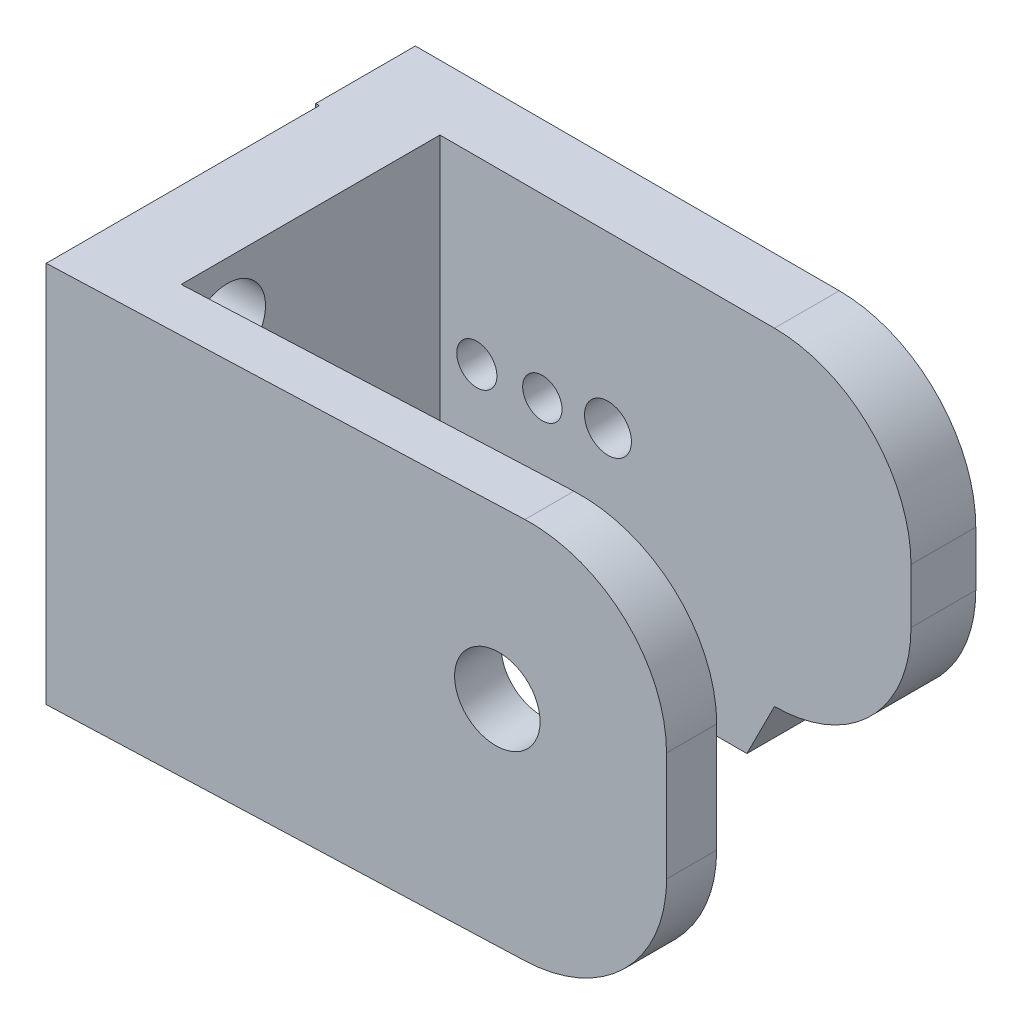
ISO-10303-21;
HEADER;
FILE_DESCRIPTION(('STEP AP214'),'2;1');
FILE_NAME('part.step','',(''),(''),'','','');
FILE_SCHEMA(('AUTOMOTIVE_DESIGN { 1 0 10303 214 1 1 1 1 }'));
ENDSEC;
DATA;
#1=APPLICATION_CONTEXT('core data for automotive mechanical design processes');
#2=APPLICATION_PROTOCOL_DEFINITION('international standard','automotive_design',2000,#1);
#3=PRODUCT_CONTEXT('',#1,'mechanical');
#4=PRODUCT('Part','Part','',(#3));
#5=PRODUCT_RELATED_PRODUCT_CATEGORY('part','',(#4));
#6=PRODUCT_DEFINITION_FORMATION('','',#4);
#7=PRODUCT_DEFINITION_CONTEXT('part definition',#1,'design');
#8=PRODUCT_DEFINITION('design','',#6,#7);
#9=PRODUCT_DEFINITION_SHAPE('','',#8);
#10=(LENGTH_UNIT() NAMED_UNIT(*) SI_UNIT(.MILLI.,.METRE.));
#11=(NAMED_UNIT(*) PLANE_ANGLE_UNIT() SI_UNIT($,.RADIAN.));
#12=(NAMED_UNIT(*) SI_UNIT($,.STERADIAN.) SOLID_ANGLE_UNIT());
#13=UNCERTAINTY_MEASURE_WITH_UNIT(LENGTH_MEASURE(1.E-05),#10,'distance_accuracy_value','');
#14=(GEOMETRIC_REPRESENTATION_CONTEXT(3) GLOBAL_UNCERTAINTY_ASSIGNED_CONTEXT((#13)) GLOBAL_UNIT_ASSIGNED_CONTEXT((#10,
#11,#12)) REPRESENTATION_CONTEXT('',''));
#15=CARTESIAN_POINT('',(0.,0.,0.));
#16=DIRECTION('',(0.,0.,1.));
#17=DIRECTION('',(1.,0.,0.));
#18=AXIS2_PLACEMENT_3D('',#15,#16,#17);
#19=CARTESIAN_POINT('',(0.,-2.,0.));
#20=DIRECTION('',(0.,1.,0.));
#21=DIRECTION('',(0.,0.,1.));
#22=AXIS2_PLACEMENT_3D('',#19,#20,#21);
#23=PLANE('',#22);
#24=DIRECTION('',(1.,0.,0.));
#25=VECTOR('',#24,1.);
#26=CARTESIAN_POINT('',(0.,-2.,-3.47523704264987));
#27=LINE('',#26,#25);
#28=CARTESIAN_POINT('',(-35.828035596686,-2.,-3.47523704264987));
#29=VERTEX_POINT('',#28);
#30=CARTESIAN_POINT('',(-20.4305070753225,-2.,-3.47523704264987));
#31=VERTEX_POINT('',#30);
#32=EDGE_CURVE('E205',#29,#31,#27,.T.);
#33=ORIENTED_EDGE('',*,*,#32,.F.);
#34=DIRECTION('',(0.,0.,1.));
#35=VECTOR('',#34,1.);
#36=CARTESIAN_POINT('',(-35.828035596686,-2.,0.));
#37=LINE('',#36,#35);
#38=CARTESIAN_POINT('',(-35.828035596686,-2.,0.));
#39=VERTEX_POINT('',#38);
#40=EDGE_CURVE('E60',#29,#39,#37,.T.);
#41=ORIENTED_EDGE('',*,*,#40,.T.);
#42=DIRECTION('',(1.,0.,0.));
#43=VECTOR('',#42,1.);
#44=CARTESIAN_POINT('',(-35.9592578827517,-2.,0.));
#45=LINE('',#44,#43);
#46=CARTESIAN_POINT('',(-35.9592578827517,-2.,0.));
#47=VERTEX_POINT('',#46);
#48=EDGE_CURVE('E341',#47,#39,#45,.T.);
#49=ORIENTED_EDGE('',*,*,#48,.F.);
#50=DIRECTION('',(0.,0.,1.));
#51=VECTOR('',#50,1.);
#52=CARTESIAN_POINT('',(-35.9592578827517,-2.,-3.6496923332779));
#53=LINE('',#52,#51);
#54=CARTESIAN_POINT('',(-35.9592578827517,-2.,-3.6496923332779));
#55=VERTEX_POINT('',#54);
#56=EDGE_CURVE('E338',#55,#47,#53,.T.);
#57=ORIENTED_EDGE('',*,*,#56,.F.);
#58=DIRECTION('',(-1.,0.,0.));
#59=VECTOR('',#58,1.);
#60=CARTESIAN_POINT('',(-35.9592578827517,-2.,-3.6496923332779));
#61=LINE('',#60,#59);
#62=CARTESIAN_POINT('',(-20.4305070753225,-2.,-3.6496923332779));
#63=VERTEX_POINT('',#62);
#64=EDGE_CURVE('E344',#63,#55,#61,.T.);
#65=ORIENTED_EDGE('',*,*,#64,.F.);
#66=DIRECTION('',(0.,0.,-1.));
#67=VECTOR('',#66,1.);
#68=CARTESIAN_POINT('',(-20.4305070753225,-2.,-1.27523704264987));
#69=LINE('',#68,#67);
#70=EDGE_CURVE('E398',#63,#31,#69,.F.);
#71=ORIENTED_EDGE('',*,*,#70,.T.);
#72=EDGE_LOOP('',(#33,#41,#49,#57,#65,#71));
#73=FACE_BOUND('',#72,.T.);
#74=ADVANCED_FACE('F45',(#73),#23,.F.);
#75=CARTESIAN_POINT('',(-35.9592578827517,-2.,0.));
#76=DIRECTION('',(0.,0.,1.));
#77=DIRECTION('',(1.,0.,0.));
#78=AXIS2_PLACEMENT_3D('',#75,#76,#77);
#79=PLANE('',#78);
#80=DIRECTION('',(1.,0.,0.));
#81=VECTOR('',#80,1.);
#82=CARTESIAN_POINT('',(-44.686094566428,-1.16426585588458,0.));
#83=LINE('',#82,#81);
#84=CARTESIAN_POINT('',(-35.9592578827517,-1.16426585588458,0.));
#85=VERTEX_POINT('',#84);
#86=CARTESIAN_POINT('',(-35.828035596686,-1.16426585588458,0.));
#87=VERTEX_POINT('',#86);
#88=EDGE_CURVE('E244',#85,#87,#83,.T.);
#89=ORIENTED_EDGE('',*,*,#88,.F.);
#90=DIRECTION('',(0.,1.,0.));
#91=VECTOR('',#90,1.);
#92=CARTESIAN_POINT('',(-35.9592578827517,-2.,0.));
#93=LINE('',#92,#91);
#94=EDGE_CURVE('E355',#47,#85,#93,.T.);
#95=ORIENTED_EDGE('',*,*,#94,.F.);
#96=ORIENTED_EDGE('',*,*,#48,.T.);
#97=DIRECTION('',(0.,-1.,0.));
#98=VECTOR('',#97,1.);
#99=CARTESIAN_POINT('',(-35.828035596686,-2.,0.));
#100=LINE('',#99,#98);
#101=EDGE_CURVE('E282',#87,#39,#100,.T.);
#102=ORIENTED_EDGE('',*,*,#101,.F.);
#103=EDGE_LOOP('',(#89,#95,#96,#102));
#104=FACE_BOUND('',#103,.T.);
#105=ADVANCED_FACE('F492',(#104),#79,.T.);
#106=CARTESIAN_POINT('',(-35.9592578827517,-2.,-3.6496923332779));
#107=DIRECTION('',(-1.,0.,0.));
#108=DIRECTION('',(0.,0.,1.));
#109=AXIS2_PLACEMENT_3D('',#106,#107,#108);
#110=PLANE('',#109);
#111=CARTESIAN_POINT('',(-35.9592578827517,0.138347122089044,0.513029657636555));
#112=DIRECTION('',(-1.,0.,0.));
#113=DIRECTION('',(0.,0.,1.));
#114=AXIS2_PLACEMENT_3D('',#111,#112,#113);
#115=CIRCLE('',#114,1.4);
#116=CARTESIAN_POINT('',(-35.9592578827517,1.44096010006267,0.));
#117=VERTEX_POINT('',#116);
#118=EDGE_CURVE('E246',#117,#85,#115,.T.);
#119=ORIENTED_EDGE('',*,*,#118,.F.);
#120=CARTESIAN_POINT('',(-35.9592578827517,10.,0.));
#121=VERTEX_POINT('',#120);
#122=EDGE_CURVE('E346',#117,#121,#93,.T.);
#123=ORIENTED_EDGE('',*,*,#122,.T.);
#124=DIRECTION('',(0.,0.,1.));
#125=VECTOR('',#124,1.);
#126=CARTESIAN_POINT('',(-35.9592578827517,10.,-3.6496923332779));
#127=LINE('',#126,#125);
#128=CARTESIAN_POINT('',(-35.9592578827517,10.,-3.6496923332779));
#129=VERTEX_POINT('',#128);
#130=EDGE_CURVE('E330',#129,#121,#127,.T.);
#131=ORIENTED_EDGE('',*,*,#130,.F.);
#132=DIRECTION('',(0.,1.,0.));
#133=VECTOR('',#132,1.);
#134=CARTESIAN_POINT('',(-35.9592578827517,-2.,-3.6496923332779));
#135=LINE('',#134,#133);
#136=CARTESIAN_POINT('',(-35.9592578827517,6.06263160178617,-3.6496923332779));
#137=VERTEX_POINT('',#136);
#138=EDGE_CURVE('E351',#137,#129,#135,.T.);
#139=ORIENTED_EDGE('',*,*,#138,.F.);
#140=DIRECTION('',(0.,0.,-1.));
#141=VECTOR('',#140,1.);
#142=CARTESIAN_POINT('',(-35.9592578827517,6.06263160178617,-3.6496923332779));
#143=LINE('',#142,#141);
#144=CARTESIAN_POINT('',(-35.9592578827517,6.06263160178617,-2.6496923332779));
#145=VERTEX_POINT('',#144);
#146=EDGE_CURVE('E324',#145,#137,#143,.T.);
#147=ORIENTED_EDGE('',*,*,#146,.F.);
#148=DIRECTION('',(0.,-1.,0.));
#149=VECTOR('',#148,1.);
#150=CARTESIAN_POINT('',(-35.9592578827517,-2.,-2.6496923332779));
#151=LINE('',#150,#149);
#152=CARTESIAN_POINT('',(-35.9592578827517,0.589269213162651,-2.6496923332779));
#153=VERTEX_POINT('',#152);
#154=EDGE_CURVE('E359',#145,#153,#151,.T.);
#155=ORIENTED_EDGE('',*,*,#154,.T.);
#156=DIRECTION('',(0.,0.,1.));
#157=VECTOR('',#156,1.);
#158=CARTESIAN_POINT('',(-35.9592578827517,0.589269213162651,-3.6496923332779));
#159=LINE('',#158,#157);
#160=CARTESIAN_POINT('',(-35.9592578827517,0.589269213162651,-3.6496923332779));
#161=VERTEX_POINT('',#160);
#162=EDGE_CURVE('E328',#161,#153,#159,.T.);
#163=ORIENTED_EDGE('',*,*,#162,.F.);
#164=EDGE_CURVE('E347',#55,#161,#135,.T.);
#165=ORIENTED_EDGE('',*,*,#164,.F.);
#166=ORIENTED_EDGE('',*,*,#56,.T.);
#167=ORIENTED_EDGE('',*,*,#94,.T.);
#168=EDGE_LOOP('',(#119,#123,#131,#139,#147,#155,#163,#165,#166,#167));
#169=FACE_BOUND('',#168,.T.);
#170=ADVANCED_FACE('F428',(#169),#110,.T.);
#171=CARTESIAN_POINT('',(-35.9592578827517,-2.,-3.6496923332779));
#172=DIRECTION('',(0.,0.,-1.));
#173=DIRECTION('',(-1.,0.,0.));
#174=AXIS2_PLACEMENT_3D('',#171,#172,#173);
#175=PLANE('',#174);
#176=DIRECTION('',(0.,1.,0.));
#177=VECTOR('',#176,1.);
#178=CARTESIAN_POINT('',(-15.4305070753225,-2.,-3.6496923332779));
#179=LINE('',#178,#177);
#180=CARTESIAN_POINT('',(-15.4305070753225,3.,-3.6496923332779));
#181=VERTEX_POINT('',#180);
#182=CARTESIAN_POINT('',(-15.4305070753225,5.,-3.6496923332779));
#183=VERTEX_POINT('',#182);
#184=EDGE_CURVE('E352',#181,#183,#179,.T.);
#185=ORIENTED_EDGE('',*,*,#184,.F.);
#186=CARTESIAN_POINT('',(-20.4305070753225,3.,-3.6496923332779));
#187=DIRECTION('',(0.,0.,-1.));
#188=DIRECTION('',(-1.,0.,0.));
#189=AXIS2_PLACEMENT_3D('',#186,#187,#188);
#190=CIRCLE('',#189,5.);
#191=EDGE_CURVE('E396',#181,#63,#190,.T.);
#192=ORIENTED_EDGE('',*,*,#191,.T.);
#193=ORIENTED_EDGE('',*,*,#64,.T.);
#194=ORIENTED_EDGE('',*,*,#164,.T.);
#195=DIRECTION('',(-0.999906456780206,0.013677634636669,0.));
#196=VECTOR('',#195,1.);
#197=CARTESIAN_POINT('',(-37.7283054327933,0.613467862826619,-3.6496923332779));
#198=LINE('',#197,#196);
#199=CARTESIAN_POINT('',(-20.6880227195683,0.380375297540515,-3.6496923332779));
#200=VERTEX_POINT('',#199);
#201=EDGE_CURVE('E303',#200,#161,#198,.T.);
#202=ORIENTED_EDGE('',*,*,#201,.F.);
#203=CARTESIAN_POINT('',(-20.6880227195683,4.29733611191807,-3.6496923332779));
#204=DIRECTION('',(0.,0.,-1.));
#205=DIRECTION('',(-1.,0.,0.));
#206=AXIS2_PLACEMENT_3D('',#203,#204,#205);
#207=CIRCLE('',#206,3.91696081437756);
#208=CARTESIAN_POINT('',(-21.2445019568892,8.17456616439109,-3.6496923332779));
#209=VERTEX_POINT('',#208);
#210=EDGE_CURVE('E313',#209,#200,#207,.T.);
#211=ORIENTED_EDGE('',*,*,#210,.F.);
#212=DIRECTION('',(0.989856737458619,0.142069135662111,0.));
#213=VECTOR('',#212,1.);
#214=CARTESIAN_POINT('',(-37.0930903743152,5.89989835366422,-3.6496923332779));
#215=LINE('',#214,#213);
#216=EDGE_CURVE('E350',#137,#209,#215,.T.);
#217=ORIENTED_EDGE('',*,*,#216,.F.);
#218=ORIENTED_EDGE('',*,*,#138,.T.);
#219=DIRECTION('',(-1.,0.,0.));
#220=VECTOR('',#219,1.);
#221=CARTESIAN_POINT('',(-35.9592578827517,10.,-3.6496923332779));
#222=LINE('',#221,#220);
#223=CARTESIAN_POINT('',(-20.4305070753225,10.,-3.6496923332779));
#224=VERTEX_POINT('',#223);
#225=EDGE_CURVE('E336',#224,#129,#222,.T.);
#226=ORIENTED_EDGE('',*,*,#225,.F.);
#227=CARTESIAN_POINT('',(-20.4305070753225,5.,-3.6496923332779));
#228=DIRECTION('',(0.,0.,-1.));
#229=DIRECTION('',(-1.,0.,0.));
#230=AXIS2_PLACEMENT_3D('',#227,#228,#229);
#231=CIRCLE('',#230,5.);
#232=EDGE_CURVE('E394',#224,#183,#231,.T.);
#233=ORIENTED_EDGE('',*,*,#232,.T.);
#234=EDGE_LOOP('',(#185,#192,#193,#194,#202,#211,#217,#218,#226,#233));
#235=FACE_BOUND('',#234,.T.);
#236=ADVANCED_FACE('F415',(#235),#175,.T.);
#237=CARTESIAN_POINT('',(-15.4305070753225,-2.,-3.6496923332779));
#238=DIRECTION('',(1.,0.,0.));
#239=DIRECTION('',(0.,0.,-1.));
#240=AXIS2_PLACEMENT_3D('',#237,#238,#239);
#241=PLANE('',#240);
#242=DIRECTION('',(0.,1.,0.));
#243=VECTOR('',#242,1.);
#244=CARTESIAN_POINT('',(-15.4305070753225,-2.,-1.27523704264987));
#245=LINE('',#244,#243);
#246=CARTESIAN_POINT('',(-15.4305070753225,3.,-1.27523704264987));
#247=VERTEX_POINT('',#246);
#248=CARTESIAN_POINT('',(-15.4305070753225,5.,-1.27523704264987));
#249=VERTEX_POINT('',#248);
#250=EDGE_CURVE('E296',#247,#249,#245,.T.);
#251=ORIENTED_EDGE('',*,*,#250,.F.);
#252=DIRECTION('',(0.,0.,-1.));
#253=VECTOR('',#252,1.);
#254=CARTESIAN_POINT('',(-15.4305070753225,3.,-3.6496923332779));
#255=LINE('',#254,#253);
#256=EDGE_CURVE('E391',#247,#181,#255,.T.);
#257=ORIENTED_EDGE('',*,*,#256,.T.);
#258=ORIENTED_EDGE('',*,*,#184,.T.);
#259=DIRECTION('',(0.,0.,-1.));
#260=VECTOR('',#259,1.);
#261=CARTESIAN_POINT('',(-15.4305070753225,5.,-3.6496923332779));
#262=LINE('',#261,#260);
#263=EDGE_CURVE('E389',#183,#249,#262,.F.);
#264=ORIENTED_EDGE('',*,*,#263,.T.);
#265=EDGE_LOOP('',(#251,#257,#258,#264));
#266=FACE_BOUND('',#265,.T.);
#267=ADVANCED_FACE('F418',(#266),#241,.T.);
#268=DIRECTION('',(1.,0.,0.));
#269=VECTOR('',#268,1.);
#270=CARTESIAN_POINT('',(-44.686094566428,1.44096010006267,0.));
#271=LINE('',#270,#269);
#272=CARTESIAN_POINT('',(-35.828035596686,1.44096010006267,0.));
#273=VERTEX_POINT('',#272);
#274=EDGE_CURVE('E240',#273,#117,#271,.F.);
#275=ORIENTED_EDGE('',*,*,#274,.F.);
#276=CARTESIAN_POINT('',(-35.828035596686,10.,0.));
#277=VERTEX_POINT('',#276);
#278=EDGE_CURVE('E283',#277,#273,#100,.T.);
#279=ORIENTED_EDGE('',*,*,#278,.F.);
#280=DIRECTION('',(1.,0.,0.));
#281=VECTOR('',#280,1.);
#282=CARTESIAN_POINT('',(-35.9592578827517,10.,0.));
#283=LINE('',#282,#281);
#284=EDGE_CURVE('E333',#121,#277,#283,.T.);
#285=ORIENTED_EDGE('',*,*,#284,.F.);
#286=ORIENTED_EDGE('',*,*,#122,.F.);
#287=EDGE_LOOP('',(#275,#279,#285,#286));
#288=FACE_BOUND('',#287,.T.);
#289=ADVANCED_FACE('F499',(#288),#79,.T.);
#290=CARTESIAN_POINT('',(0.,10.,0.));
#291=DIRECTION('',(0.,1.,0.));
#292=DIRECTION('',(0.,0.,1.));
#293=AXIS2_PLACEMENT_3D('',#290,#291,#292);
#294=PLANE('',#293);
#295=DIRECTION('',(0.999288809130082,0.,-0.0377077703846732));
#296=VECTOR('',#295,1.);
#297=CARTESIAN_POINT('',(-13.9315382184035,10.,9.17798467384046));
#298=LINE('',#297,#296);
#299=CARTESIAN_POINT('',(-35.828035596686,10.,10.0042403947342));
#300=VERTEX_POINT('',#299);
#301=CARTESIAN_POINT('',(-18.9315382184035,10.,9.36665770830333));
#302=VERTEX_POINT('',#301);
#303=EDGE_CURVE('E261',#300,#302,#298,.T.);
#304=ORIENTED_EDGE('',*,*,#303,.T.);
#305=DIRECTION('',(0.,0.,-1.));
#306=VECTOR('',#305,1.);
#307=CARTESIAN_POINT('',(-18.9315382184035,10.,0.));
#308=LINE('',#307,#306);
#309=CARTESIAN_POINT('',(-18.9315382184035,10.,7.57083289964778));
#310=VERTEX_POINT('',#309);
#311=EDGE_CURVE('E386',#302,#310,#308,.T.);
#312=ORIENTED_EDGE('',*,*,#311,.T.);
#313=DIRECTION('',(-0.998946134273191,0.,0.0458979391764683));
#314=VECTOR('',#313,1.);
#315=CARTESIAN_POINT('',(-32.686094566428,10.,8.20280470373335));
#316=LINE('',#315,#314);
#317=CARTESIAN_POINT('',(-32.686094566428,10.,8.20280470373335));
#318=VERTEX_POINT('',#317);
#319=EDGE_CURVE('E264',#310,#318,#316,.T.);
#320=ORIENTED_EDGE('',*,*,#319,.T.);
#321=DIRECTION('',(0.,0.,-1.));
#322=VECTOR('',#321,1.);
#323=CARTESIAN_POINT('',(-32.686094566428,10.,-1.27523704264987));
#324=LINE('',#323,#322);
#325=CARTESIAN_POINT('',(-32.686094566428,10.,-1.27523704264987));
#326=VERTEX_POINT('',#325);
#327=EDGE_CURVE('E251',#318,#326,#324,.T.);
#328=ORIENTED_EDGE('',*,*,#327,.T.);
#329=DIRECTION('',(-1.,0.,0.));
#330=VECTOR('',#329,1.);
#331=CARTESIAN_POINT('',(-14.9799626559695,10.,-1.27523704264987));
#332=LINE('',#331,#330);
#333=CARTESIAN_POINT('',(-20.4305070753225,10.,-1.27523704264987));
#334=VERTEX_POINT('',#333);
#335=EDGE_CURVE('E286',#334,#326,#332,.T.);
#336=ORIENTED_EDGE('',*,*,#335,.F.);
#337=DIRECTION('',(0.,0.,-1.));
#338=VECTOR('',#337,1.);
#339=CARTESIAN_POINT('',(-20.4305070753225,10.,0.));
#340=LINE('',#339,#338);
#341=EDGE_CURVE('E383',#334,#224,#340,.T.);
#342=ORIENTED_EDGE('',*,*,#341,.T.);
#343=ORIENTED_EDGE('',*,*,#225,.T.);
#344=ORIENTED_EDGE('',*,*,#130,.T.);
#345=ORIENTED_EDGE('',*,*,#284,.T.);
#346=DIRECTION('',(0.,0.,1.));
#347=VECTOR('',#346,1.);
#348=CARTESIAN_POINT('',(-35.828035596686,10.,10.0042403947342));
#349=LINE('',#348,#347);
#350=EDGE_CURVE('E259',#277,#300,#349,.T.);
#351=ORIENTED_EDGE('',*,*,#350,.T.);
#352=EDGE_LOOP('',(#304,#312,#320,#328,#336,#342,#343,#344,#345,#351));
#353=FACE_BOUND('',#352,.T.);
#354=ADVANCED_FACE('F410',(#353),#294,.T.);
#355=CARTESIAN_POINT('',(-37.7283054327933,0.613467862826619,-2.6496923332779));
#356=DIRECTION('',(-0.013677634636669,-0.999906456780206,0.));
#357=DIRECTION('',(0.999906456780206,-0.013677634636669,0.));
#358=AXIS2_PLACEMENT_3D('',#355,#356,#357);
#359=PLANE('',#358);
#360=ORIENTED_EDGE('',*,*,#162,.T.);
#361=DIRECTION('',(-0.999906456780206,0.013677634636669,0.));
#362=VECTOR('',#361,1.);
#363=CARTESIAN_POINT('',(-37.7283054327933,0.613467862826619,-2.6496923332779));
#364=LINE('',#363,#362);
#365=CARTESIAN_POINT('',(-20.6880227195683,0.380375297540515,-2.6496923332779));
#366=VERTEX_POINT('',#365);
#367=EDGE_CURVE('E309',#366,#153,#364,.T.);
#368=ORIENTED_EDGE('',*,*,#367,.F.);
#369=DIRECTION('',(0.,0.,-1.));
#370=VECTOR('',#369,1.);
#371=CARTESIAN_POINT('',(-20.6880227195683,0.380375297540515,-2.6496923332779));
#372=LINE('',#371,#370);
#373=EDGE_CURVE('E322',#366,#200,#372,.T.);
#374=ORIENTED_EDGE('',*,*,#373,.T.);
#375=ORIENTED_EDGE('',*,*,#201,.T.);
#376=EDGE_LOOP('',(#360,#368,#374,#375));
#377=FACE_BOUND('',#376,.T.);
#378=ADVANCED_FACE('F434',(#377),#359,.F.);
#379=CARTESIAN_POINT('',(-20.6880227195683,4.29733611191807,-2.6496923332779));
#380=DIRECTION('',(0.,0.,-1.));
#381=DIRECTION('',(-1.,0.,0.));
#382=AXIS2_PLACEMENT_3D('',#379,#380,#381);
#383=CYLINDRICAL_SURFACE('',#382,3.91696081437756);
#384=ORIENTED_EDGE('',*,*,#210,.T.);
#385=ORIENTED_EDGE('',*,*,#373,.F.);
#386=CARTESIAN_POINT('',(-20.6880227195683,4.29733611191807,-2.6496923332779));
#387=DIRECTION('',(0.,0.,-1.));
#388=DIRECTION('',(-1.,0.,0.));
#389=AXIS2_PLACEMENT_3D('',#386,#387,#388);
#390=CIRCLE('',#389,3.91696081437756);
#391=CARTESIAN_POINT('',(-21.2445019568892,8.17456616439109,-2.6496923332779));
#392=VERTEX_POINT('',#391);
#393=EDGE_CURVE('E315',#392,#366,#390,.T.);
#394=ORIENTED_EDGE('',*,*,#393,.F.);
#395=DIRECTION('',(0.,0.,-1.));
#396=VECTOR('',#395,1.);
#397=CARTESIAN_POINT('',(-21.2445019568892,8.17456616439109,-2.6496923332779));
#398=LINE('',#397,#396);
#399=EDGE_CURVE('E318',#392,#209,#398,.T.);
#400=ORIENTED_EDGE('',*,*,#399,.T.);
#401=EDGE_LOOP('',(#384,#385,#394,#400));
#402=FACE_BOUND('',#401,.T.);
#403=ADVANCED_FACE('F438',(#402),#383,.F.);
#404=CARTESIAN_POINT('',(-21.2445019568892,8.17456616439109,-2.6496923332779));
#405=DIRECTION('',(-0.142069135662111,0.989856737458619,0.));
#406=DIRECTION('',(-0.989856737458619,-0.142069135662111,0.));
#407=AXIS2_PLACEMENT_3D('',#404,#405,#406);
#408=PLANE('',#407);
#409=ORIENTED_EDGE('',*,*,#146,.T.);
#410=ORIENTED_EDGE('',*,*,#216,.T.);
#411=ORIENTED_EDGE('',*,*,#399,.F.);
#412=DIRECTION('',(0.989856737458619,0.142069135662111,0.));
#413=VECTOR('',#412,1.);
#414=CARTESIAN_POINT('',(-21.2445019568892,8.17456616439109,-2.6496923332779));
#415=LINE('',#414,#413);
#416=EDGE_CURVE('E312',#145,#392,#415,.T.);
#417=ORIENTED_EDGE('',*,*,#416,.F.);
#418=EDGE_LOOP('',(#409,#410,#411,#417));
#419=FACE_BOUND('',#418,.T.);
#420=ADVANCED_FACE('F442',(#419),#408,.F.);
#421=CARTESIAN_POINT('',(-20.6880227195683,4.29733611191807,-2.6496923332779));
#422=DIRECTION('',(0.,0.,-1.));
#423=DIRECTION('',(-1.,0.,0.));
#424=AXIS2_PLACEMENT_3D('',#421,#422,#423);
#425=PLANE('',#424);
#426=CARTESIAN_POINT('',(-31.3337235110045,3.39696779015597,-2.6496923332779));
#427=DIRECTION('',(0.,0.,-1.));
#428=DIRECTION('',(-1.,0.,0.));
#429=AXIS2_PLACEMENT_3D('',#426,#427,#428);
#430=CIRCLE('',#429,0.73588943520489);
#431=CARTESIAN_POINT('',(-32.0696129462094,3.39696779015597,-2.6496923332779));
#432=VERTEX_POINT('',#431);
#433=EDGE_CURVE('E300',#432,#432,#430,.T.);
#434=ORIENTED_EDGE('',*,*,#433,.F.);
#435=EDGE_LOOP('',(#434));
#436=FACE_BOUND('',#435,.T.);
#437=CARTESIAN_POINT('',(-28.9339325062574,3.53139617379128,-2.6496923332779));
#438=DIRECTION('',(0.,0.,-1.));
#439=DIRECTION('',(-1.,0.,0.));
#440=AXIS2_PLACEMENT_3D('',#437,#438,#439);
#441=CIRCLE('',#440,0.720970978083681);
#442=CARTESIAN_POINT('',(-29.6549034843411,3.53139617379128,-2.6496923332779));
#443=VERTEX_POINT('',#442);
#444=EDGE_CURVE('E304',#443,#443,#441,.T.);
#445=ORIENTED_EDGE('',*,*,#444,.F.);
#446=EDGE_LOOP('',(#445));
#447=FACE_BOUND('',#446,.T.);
#448=CARTESIAN_POINT('',(-26.5287876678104,3.77558013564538,-2.6496923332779));
#449=DIRECTION('',(0.,0.,-1.));
#450=DIRECTION('',(-1.,0.,0.));
#451=AXIS2_PLACEMENT_3D('',#448,#449,#450);
#452=CIRCLE('',#451,0.858730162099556);
#453=CARTESIAN_POINT('',(-27.38751782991,3.77558013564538,-2.6496923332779));
#454=VERTEX_POINT('',#453);
#455=EDGE_CURVE('E299',#454,#454,#452,.T.);
#456=ORIENTED_EDGE('',*,*,#455,.F.);
#457=EDGE_LOOP('',(#456));
#458=FACE_BOUND('',#457,.T.);
#459=ORIENTED_EDGE('',*,*,#416,.T.);
#460=ORIENTED_EDGE('',*,*,#393,.T.);
#461=ORIENTED_EDGE('',*,*,#367,.T.);
#462=ORIENTED_EDGE('',*,*,#154,.F.);
#463=EDGE_LOOP('',(#459,#460,#461,#462));
#464=FACE_BOUND('',#463,.T.);
#465=ADVANCED_FACE('F561',(#436,#447,#458,#464),#425,.T.);
#466=CARTESIAN_POINT('',(-26.5287876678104,3.77558013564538,3.3503076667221));
#467=DIRECTION('',(0.,0.,-1.));
#468=DIRECTION('',(-1.,0.,0.));
#469=AXIS2_PLACEMENT_3D('',#466,#467,#468);
#470=CYLINDRICAL_SURFACE('',#469,0.858730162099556);
#471=CARTESIAN_POINT('',(-26.5287876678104,3.77558013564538,-1.27523704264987));
#472=DIRECTION('',(0.,0.,-1.));
#473=DIRECTION('',(-1.,0.,0.));
#474=AXIS2_PLACEMENT_3D('',#471,#472,#473);
#475=CIRCLE('',#474,0.858730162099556);
#476=CARTESIAN_POINT('',(-27.38751782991,3.77558013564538,-1.27523704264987));
#477=VERTEX_POINT('',#476);
#478=EDGE_CURVE('E293',#477,#477,#475,.F.);
#479=ORIENTED_EDGE('',*,*,#478,.T.);
#480=EDGE_LOOP('',(#479));
#481=FACE_BOUND('',#480,.T.);
#482=ORIENTED_EDGE('',*,*,#455,.T.);
#483=EDGE_LOOP('',(#482));
#484=FACE_BOUND('',#483,.T.);
#485=ADVANCED_FACE('F557',(#481,#484),#470,.F.);
#486=CARTESIAN_POINT('',(-28.9339325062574,3.53139617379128,3.3503076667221));
#487=DIRECTION('',(0.,0.,-1.));
#488=DIRECTION('',(-1.,0.,0.));
#489=AXIS2_PLACEMENT_3D('',#486,#487,#488);
#490=CYLINDRICAL_SURFACE('',#489,0.720970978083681);
#491=CARTESIAN_POINT('',(-28.9339325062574,3.53139617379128,-1.27523704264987));
#492=DIRECTION('',(0.,0.,-1.));
#493=DIRECTION('',(-1.,0.,0.));
#494=AXIS2_PLACEMENT_3D('',#491,#492,#493);
#495=CIRCLE('',#494,0.720970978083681);
#496=CARTESIAN_POINT('',(-29.6549034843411,3.53139617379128,-1.27523704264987));
#497=VERTEX_POINT('',#496);
#498=EDGE_CURVE('E290',#497,#497,#495,.F.);
#499=ORIENTED_EDGE('',*,*,#498,.T.);
#500=EDGE_LOOP('',(#499));
#501=FACE_BOUND('',#500,.T.);
#502=ORIENTED_EDGE('',*,*,#444,.T.);
#503=EDGE_LOOP('',(#502));
#504=FACE_BOUND('',#503,.T.);
#505=ADVANCED_FACE('F553',(#501,#504),#490,.F.);
#506=CARTESIAN_POINT('',(-31.3337235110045,3.39696779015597,3.3503076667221));
#507=DIRECTION('',(0.,0.,-1.));
#508=DIRECTION('',(-1.,0.,0.));
#509=AXIS2_PLACEMENT_3D('',#506,#507,#508);
#510=CYLINDRICAL_SURFACE('',#509,0.73588943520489);
#511=CARTESIAN_POINT('',(-31.3337235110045,3.39696779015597,-1.27523704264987));
#512=DIRECTION('',(0.,0.,-1.));
#513=DIRECTION('',(-1.,0.,0.));
#514=AXIS2_PLACEMENT_3D('',#511,#512,#513);
#515=CIRCLE('',#514,0.73588943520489);
#516=CARTESIAN_POINT('',(-32.0696129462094,3.39696779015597,-1.27523704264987));
#517=VERTEX_POINT('',#516);
#518=EDGE_CURVE('E289',#517,#517,#515,.F.);
#519=ORIENTED_EDGE('',*,*,#518,.T.);
#520=EDGE_LOOP('',(#519));
#521=FACE_BOUND('',#520,.T.);
#522=ORIENTED_EDGE('',*,*,#433,.T.);
#523=EDGE_LOOP('',(#522));
#524=FACE_BOUND('',#523,.T.);
#525=ADVANCED_FACE('F486',(#521,#524),#510,.F.);
#526=CARTESIAN_POINT('',(-14.9799626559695,-8.00000000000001,-1.27523704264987));
#527=DIRECTION('',(0.,0.,-1.));
#528=DIRECTION('',(-1.,0.,0.));
#529=AXIS2_PLACEMENT_3D('',#526,#527,#528);
#530=PLANE('',#529);
#531=ORIENTED_EDGE('',*,*,#335,.T.);
#532=DIRECTION('',(0.,1.,0.));
#533=VECTOR('',#532,1.);
#534=CARTESIAN_POINT('',(-32.686094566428,-4.00000000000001,-1.27523704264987));
#535=LINE('',#534,#533);
#536=CARTESIAN_POINT('',(-32.686094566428,-4.00000000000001,-1.27523704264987));
#537=VERTEX_POINT('',#536);
#538=EDGE_CURVE('E268',#537,#326,#535,.T.);
#539=ORIENTED_EDGE('',*,*,#538,.F.);
#540=DIRECTION('',(-1.,0.,0.));
#541=VECTOR('',#540,1.);
#542=CARTESIAN_POINT('',(-35.828035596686,-4.00000000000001,-1.27523704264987));
#543=LINE('',#542,#541);
#544=CARTESIAN_POINT('',(-21.4404238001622,-4.00000000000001,-1.27523704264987));
#545=VERTEX_POINT('',#544);
#546=EDGE_CURVE('E226',#545,#537,#543,.T.);
#547=ORIENTED_EDGE('',*,*,#546,.F.);
#548=DIRECTION('',(-0.450750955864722,-0.892649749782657,0.));
#549=VECTOR('',#548,1.);
#550=CARTESIAN_POINT('',(-21.4404238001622,-4.00000000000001,-1.27523704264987));
#551=LINE('',#550,#549);
#552=CARTESIAN_POINT('',(-20.4305070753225,-2.,-1.27523704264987));
#553=VERTEX_POINT('',#552);
#554=EDGE_CURVE('E213',#553,#545,#551,.T.);
#555=ORIENTED_EDGE('',*,*,#554,.F.);
#556=CARTESIAN_POINT('',(-20.4305070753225,3.,-1.27523704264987));
#557=DIRECTION('',(0.,0.,-1.));
#558=DIRECTION('',(-1.,0.,0.));
#559=AXIS2_PLACEMENT_3D('',#556,#557,#558);
#560=CIRCLE('',#559,5.);
#561=EDGE_CURVE('E13',#553,#247,#560,.F.);
#562=ORIENTED_EDGE('',*,*,#561,.T.);
#563=ORIENTED_EDGE('',*,*,#250,.T.);
#564=CARTESIAN_POINT('',(-20.4305070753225,5.,-1.27523704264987));
#565=DIRECTION('',(0.,0.,-1.));
#566=DIRECTION('',(-1.,0.,0.));
#567=AXIS2_PLACEMENT_3D('',#564,#565,#566);
#568=CIRCLE('',#567,5.);
#569=EDGE_CURVE('E53',#249,#334,#568,.F.);
#570=ORIENTED_EDGE('',*,*,#569,.T.);
#571=EDGE_LOOP('',(#531,#539,#547,#555,#562,#563,#570));
#572=FACE_BOUND('',#571,.T.);
#573=ORIENTED_EDGE('',*,*,#478,.F.);
#574=EDGE_LOOP('',(#573));
#575=FACE_BOUND('',#574,.T.);
#576=ORIENTED_EDGE('',*,*,#518,.F.);
#577=EDGE_LOOP('',(#576));
#578=FACE_BOUND('',#577,.T.);
#579=ORIENTED_EDGE('',*,*,#498,.F.);
#580=EDGE_LOOP('',(#579));
#581=FACE_BOUND('',#580,.T.);
#582=ADVANCED_FACE('F402',(#572,#575,#578,#581),#530,.F.);
#583=CARTESIAN_POINT('',(-32.686094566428,-4.00000000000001,-1.27523704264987));
#584=DIRECTION('',(1.,0.,0.));
#585=DIRECTION('',(0.,0.,-1.));
#586=AXIS2_PLACEMENT_3D('',#583,#584,#585);
#587=PLANE('',#586);
#588=CARTESIAN_POINT('',(-32.686094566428,7.78352574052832,6.51309421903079));
#589=DIRECTION('',(1.,0.,0.));
#590=DIRECTION('',(0.,0.,-1.));
#591=AXIS2_PLACEMENT_3D('',#588,#589,#590);
#592=CIRCLE('',#591,1.4);
#593=CARTESIAN_POINT('',(-32.686094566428,7.78352574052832,5.11309421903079));
#594=VERTEX_POINT('',#593);
#595=EDGE_CURVE('E237',#594,#594,#592,.T.);
#596=ORIENTED_EDGE('',*,*,#595,.F.);
#597=EDGE_LOOP('',(#596));
#598=FACE_BOUND('',#597,.T.);
#599=CARTESIAN_POINT('',(-32.686094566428,0.138347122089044,0.513029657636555));
#600=DIRECTION('',(1.,0.,0.));
#601=DIRECTION('',(0.,0.,-1.));
#602=AXIS2_PLACEMENT_3D('',#599,#600,#601);
#603=CIRCLE('',#602,1.4);
#604=CARTESIAN_POINT('',(-32.686094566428,0.138347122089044,-0.886970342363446));
#605=VERTEX_POINT('',#604);
#606=EDGE_CURVE('E236',#605,#605,#603,.T.);
#607=ORIENTED_EDGE('',*,*,#606,.F.);
#608=EDGE_LOOP('',(#607));
#609=FACE_BOUND('',#608,.T.);
#610=ORIENTED_EDGE('',*,*,#327,.F.);
#611=DIRECTION('',(0.,1.,0.));
#612=VECTOR('',#611,1.);
#613=CARTESIAN_POINT('',(-32.686094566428,-4.00000000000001,8.20280470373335));
#614=LINE('',#613,#612);
#615=CARTESIAN_POINT('',(-32.686094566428,-4.00000000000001,8.20280470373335));
#616=VERTEX_POINT('',#615);
#617=EDGE_CURVE('E270',#616,#318,#614,.T.);
#618=ORIENTED_EDGE('',*,*,#617,.F.);
#619=DIRECTION('',(0.,0.,-1.));
#620=VECTOR('',#619,1.);
#621=CARTESIAN_POINT('',(-32.686094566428,-4.00000000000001,3.6799703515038));
#622=LINE('',#621,#620);
#623=EDGE_CURVE('E256',#616,#537,#622,.T.);
#624=ORIENTED_EDGE('',*,*,#623,.T.);
#625=ORIENTED_EDGE('',*,*,#538,.T.);
#626=EDGE_LOOP('',(#610,#618,#624,#625));
#627=FACE_BOUND('',#626,.T.);
#628=ADVANCED_FACE('F476',(#598,#609,#627),#587,.T.);
#629=CARTESIAN_POINT('',(-32.686094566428,-4.00000000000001,8.20280470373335));
#630=DIRECTION('',(-0.0458979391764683,0.,-0.998946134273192));
#631=DIRECTION('',(-0.998946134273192,0.,0.0458979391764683));
#632=AXIS2_PLACEMENT_3D('',#629,#630,#631);
#633=PLANE('',#632);
#634=CARTESIAN_POINT('',(-19.9711829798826,3.84055055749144,7.61860079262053));
#635=DIRECTION('',(-0.0458979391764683,0.,-0.998946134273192));
#636=DIRECTION('',(-0.998946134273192,0.,0.0458979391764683));
#637=AXIS2_PLACEMENT_3D('',#634,#635,#636);
#638=ELLIPSE('',#637,1.5095305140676,1.50947979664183);
#639=CARTESIAN_POINT('',(-21.4791226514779,3.84055055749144,7.68788513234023));
#640=VERTEX_POINT('',#639);
#641=EDGE_CURVE('E233',#640,#640,#638,.T.);
#642=ORIENTED_EDGE('',*,*,#641,.F.);
#643=EDGE_LOOP('',(#642));
#644=FACE_BOUND('',#643,.T.);
#645=DIRECTION('',(0.,1.,0.));
#646=VECTOR('',#645,1.);
#647=CARTESIAN_POINT('',(-13.9315382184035,-4.00000000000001,7.34110109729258));
#648=LINE('',#647,#646);
#649=CARTESIAN_POINT('',(-13.9315382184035,0.999999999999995,7.34110109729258));
#650=VERTEX_POINT('',#649);
#651=CARTESIAN_POINT('',(-13.9315382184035,5.,7.34110109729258));
#652=VERTEX_POINT('',#651);
#653=EDGE_CURVE('E273',#650,#652,#648,.T.);
#654=ORIENTED_EDGE('',*,*,#653,.F.);
#655=CARTESIAN_POINT('',(-18.9315382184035,0.999999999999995,7.57083289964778));
#656=DIRECTION('',(-0.0458979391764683,0.,-0.998946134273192));
#657=DIRECTION('',(-0.998946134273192,0.,0.0458979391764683));
#658=AXIS2_PLACEMENT_3D('',#655,#656,#657);
#659=ELLIPSE('',#658,5.00527488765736,5.);
#660=CARTESIAN_POINT('',(-18.9315382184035,-4.00000000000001,7.57083289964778));
#661=VERTEX_POINT('',#660);
#662=EDGE_CURVE('E375',#650,#661,#659,.T.);
#663=ORIENTED_EDGE('',*,*,#662,.T.);
#664=DIRECTION('',(-0.998946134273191,0.,0.0458979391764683));
#665=VECTOR('',#664,1.);
#666=CARTESIAN_POINT('',(-32.686094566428,-4.00000000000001,8.20280470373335));
#667=LINE('',#666,#665);
#668=EDGE_CURVE('E254',#661,#616,#667,.T.);
#669=ORIENTED_EDGE('',*,*,#668,.T.);
#670=ORIENTED_EDGE('',*,*,#617,.T.);
#671=ORIENTED_EDGE('',*,*,#319,.F.);
#672=CARTESIAN_POINT('',(-18.9315382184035,5.,7.57083289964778));
#673=DIRECTION('',(-0.0458979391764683,0.,-0.998946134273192));
#674=DIRECTION('',(0.998946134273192,0.,-0.0458979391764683));
#675=AXIS2_PLACEMENT_3D('',#672,#673,#674);
#676=ELLIPSE('',#675,5.00527488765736,5.);
#677=EDGE_CURVE('E373',#310,#652,#676,.T.);
#678=ORIENTED_EDGE('',*,*,#677,.T.);
#679=EDGE_LOOP('',(#654,#663,#669,#670,#671,#678));
#680=FACE_BOUND('',#679,.T.);
#681=ADVANCED_FACE('F464',(#644,#680),#633,.T.);
#682=CARTESIAN_POINT('',(-13.9315382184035,-4.00000000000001,7.34110109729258));
#683=DIRECTION('',(1.,0.,0.));
#684=DIRECTION('',(0.,0.,-1.));
#685=AXIS2_PLACEMENT_3D('',#682,#683,#684);
#686=PLANE('',#685);
#687=DIRECTION('',(0.,1.,0.));
#688=VECTOR('',#687,1.);
#689=CARTESIAN_POINT('',(-13.9315382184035,-4.00000000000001,9.17798467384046));
#690=LINE('',#689,#688);
#691=CARTESIAN_POINT('',(-13.9315382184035,0.999999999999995,9.17798467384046));
#692=VERTEX_POINT('',#691);
#693=CARTESIAN_POINT('',(-13.9315382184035,5.,9.17798467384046));
#694=VERTEX_POINT('',#693);
#695=EDGE_CURVE('E276',#692,#694,#690,.T.);
#696=ORIENTED_EDGE('',*,*,#695,.F.);
#697=DIRECTION('',(0.,0.,-1.));
#698=VECTOR('',#697,1.);
#699=CARTESIAN_POINT('',(-13.9315382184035,0.999999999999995,7.34110109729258));
#700=LINE('',#699,#698);
#701=EDGE_CURVE('E370',#692,#650,#700,.T.);
#702=ORIENTED_EDGE('',*,*,#701,.T.);
#703=ORIENTED_EDGE('',*,*,#653,.T.);
#704=DIRECTION('',(0.,0.,-1.));
#705=VECTOR('',#704,1.);
#706=CARTESIAN_POINT('',(-13.9315382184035,5.,7.34110109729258));
#707=LINE('',#706,#705);
#708=EDGE_CURVE('E366',#652,#694,#707,.F.);
#709=ORIENTED_EDGE('',*,*,#708,.T.);
#710=EDGE_LOOP('',(#696,#702,#703,#709));
#711=FACE_BOUND('',#710,.T.);
#712=ADVANCED_FACE('F467',(#711),#686,.T.);
#713=CARTESIAN_POINT('',(-13.9315382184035,-4.00000000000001,9.17798467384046));
#714=DIRECTION('',(0.0377077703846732,0.,0.999288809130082));
#715=DIRECTION('',(0.999288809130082,0.,-0.0377077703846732));
#716=AXIS2_PLACEMENT_3D('',#713,#714,#715);
#717=PLANE('',#716);
#718=CARTESIAN_POINT('',(-19.9038362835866,3.84055055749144,9.40334699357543));
#719=DIRECTION('',(0.0377077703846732,0.,0.999288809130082));
#720=DIRECTION('',(0.999288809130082,0.,-0.0377077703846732));
#721=AXIS2_PLACEMENT_3D('',#718,#719,#720);
#722=CIRCLE('',#721,1.50947979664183);
#723=CARTESIAN_POINT('',(-18.3954300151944,3.84055055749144,9.34642787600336));
#724=VERTEX_POINT('',#723);
#725=EDGE_CURVE('E230',#724,#724,#722,.T.);
#726=ORIENTED_EDGE('',*,*,#725,.F.);
#727=EDGE_LOOP('',(#726));
#728=FACE_BOUND('',#727,.T.);
#729=DIRECTION('',(0.999288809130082,0.,-0.0377077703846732));
#730=VECTOR('',#729,1.);
#731=CARTESIAN_POINT('',(-13.9315382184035,-4.00000000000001,9.17798467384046));
#732=LINE('',#731,#730);
#733=CARTESIAN_POINT('',(-35.828035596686,-4.00000000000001,10.0042403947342));
#734=VERTEX_POINT('',#733);
#735=CARTESIAN_POINT('',(-18.9315382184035,-4.00000000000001,9.36665770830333));
#736=VERTEX_POINT('',#735);
#737=EDGE_CURVE('E250',#734,#736,#732,.T.);
#738=ORIENTED_EDGE('',*,*,#737,.T.);
#739=CARTESIAN_POINT('',(-18.9315382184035,0.999999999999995,9.36665770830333));
#740=DIRECTION('',(0.0377077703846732,0.,0.999288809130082));
#741=DIRECTION('',(-0.999288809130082,0.,0.0377077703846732));
#742=AXIS2_PLACEMENT_3D('',#739,#740,#741);
#743=ELLIPSE('',#742,5.00355848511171,5.);
#744=EDGE_CURVE('E381',#736,#692,#743,.T.);
#745=ORIENTED_EDGE('',*,*,#744,.T.);
#746=ORIENTED_EDGE('',*,*,#695,.T.);
#747=CARTESIAN_POINT('',(-18.9315382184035,5.,9.36665770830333));
#748=DIRECTION('',(0.0377077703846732,0.,0.999288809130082));
#749=DIRECTION('',(0.999288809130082,0.,-0.0377077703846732));
#750=AXIS2_PLACEMENT_3D('',#747,#748,#749);
#751=ELLIPSE('',#750,5.00355848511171,5.);
#752=EDGE_CURVE('E379',#694,#302,#751,.T.);
#753=ORIENTED_EDGE('',*,*,#752,.T.);
#754=ORIENTED_EDGE('',*,*,#303,.F.);
#755=DIRECTION('',(0.,1.,0.));
#756=VECTOR('',#755,1.);
#757=CARTESIAN_POINT('',(-35.828035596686,-4.00000000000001,10.0042403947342));
#758=LINE('',#757,#756);
#759=EDGE_CURVE('E258',#734,#300,#758,.T.);
#760=ORIENTED_EDGE('',*,*,#759,.F.);
#761=EDGE_LOOP('',(#738,#745,#746,#753,#754,#760));
#762=FACE_BOUND('',#761,.T.);
#763=ADVANCED_FACE('F455',(#728,#762),#717,.T.);
#764=CARTESIAN_POINT('',(-35.828035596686,-4.00000000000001,10.0042403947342));
#765=DIRECTION('',(-1.,0.,0.));
#766=DIRECTION('',(0.,0.,1.));
#767=AXIS2_PLACEMENT_3D('',#764,#765,#766);
#768=PLANE('',#767);
#769=CARTESIAN_POINT('',(-35.828035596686,7.78352574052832,6.51309421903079));
#770=DIRECTION('',(-1.,0.,0.));
#771=DIRECTION('',(0.,0.,1.));
#772=AXIS2_PLACEMENT_3D('',#769,#770,#771);
#773=CIRCLE('',#772,1.4);
#774=CARTESIAN_POINT('',(-35.828035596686,7.78352574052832,7.91309421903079));
#775=VERTEX_POINT('',#774);
#776=EDGE_CURVE('E248',#775,#775,#773,.T.);
#777=ORIENTED_EDGE('',*,*,#776,.F.);
#778=EDGE_LOOP('',(#777));
#779=FACE_BOUND('',#778,.T.);
#780=CARTESIAN_POINT('',(-35.828035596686,0.138347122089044,0.513029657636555));
#781=DIRECTION('',(-1.,0.,0.));
#782=DIRECTION('',(0.,0.,1.));
#783=AXIS2_PLACEMENT_3D('',#780,#781,#782);
#784=CIRCLE('',#783,1.4);
#785=EDGE_CURVE('E362',#87,#273,#784,.T.);
#786=ORIENTED_EDGE('',*,*,#785,.F.);
#787=ORIENTED_EDGE('',*,*,#101,.T.);
#788=ORIENTED_EDGE('',*,*,#40,.F.);
#789=DIRECTION('',(0.,1.,0.));
#790=VECTOR('',#789,1.);
#791=CARTESIAN_POINT('',(-35.828035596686,-2.,-3.47523704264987));
#792=LINE('',#791,#790);
#793=CARTESIAN_POINT('',(-35.828035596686,-4.00000000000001,-3.47523704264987));
#794=VERTEX_POINT('',#793);
#795=EDGE_CURVE('E207',#794,#29,#792,.T.);
#796=ORIENTED_EDGE('',*,*,#795,.F.);
#797=DIRECTION('',(0.,0.,1.));
#798=VECTOR('',#797,1.);
#799=CARTESIAN_POINT('',(-35.828035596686,-4.00000000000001,-1.27523704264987));
#800=LINE('',#799,#798);
#801=EDGE_CURVE('E221',#794,#734,#800,.T.);
#802=ORIENTED_EDGE('',*,*,#801,.T.);
#803=ORIENTED_EDGE('',*,*,#759,.T.);
#804=ORIENTED_EDGE('',*,*,#350,.F.);
#805=ORIENTED_EDGE('',*,*,#278,.T.);
#806=EDGE_LOOP('',(#786,#787,#788,#796,#802,#803,#804,#805));
#807=FACE_BOUND('',#806,.T.);
#808=ADVANCED_FACE('F451',(#779,#807),#768,.T.);
#809=CARTESIAN_POINT('',(0.,-4.00000000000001,0.));
#810=DIRECTION('',(0.,1.,0.));
#811=DIRECTION('',(0.,0.,1.));
#812=AXIS2_PLACEMENT_3D('',#809,#810,#811);
#813=PLANE('',#812);
#814=ORIENTED_EDGE('',*,*,#668,.F.);
#815=DIRECTION('',(0.,0.,-1.));
#816=VECTOR('',#815,1.);
#817=CARTESIAN_POINT('',(-18.9315382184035,-4.00000000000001,9.17798467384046));
#818=LINE('',#817,#816);
#819=EDGE_CURVE('E377',#661,#736,#818,.F.);
#820=ORIENTED_EDGE('',*,*,#819,.T.);
#821=ORIENTED_EDGE('',*,*,#737,.F.);
#822=ORIENTED_EDGE('',*,*,#801,.F.);
#823=DIRECTION('',(-1.,0.,0.));
#824=VECTOR('',#823,1.);
#825=CARTESIAN_POINT('',(-35.828035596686,-4.00000000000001,-3.47523704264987));
#826=LINE('',#825,#824);
#827=CARTESIAN_POINT('',(-21.4404238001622,-4.00000000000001,-3.47523704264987));
#828=VERTEX_POINT('',#827);
#829=EDGE_CURVE('E204',#828,#794,#826,.T.);
#830=ORIENTED_EDGE('',*,*,#829,.F.);
#831=DIRECTION('',(0.,0.,1.));
#832=VECTOR('',#831,1.);
#833=CARTESIAN_POINT('',(-21.4404238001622,-4.00000000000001,-3.47523704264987));
#834=LINE('',#833,#832);
#835=EDGE_CURVE('E210',#828,#545,#834,.T.);
#836=ORIENTED_EDGE('',*,*,#835,.T.);
#837=ORIENTED_EDGE('',*,*,#546,.T.);
#838=ORIENTED_EDGE('',*,*,#623,.F.);
#839=EDGE_LOOP('',(#814,#820,#821,#822,#830,#836,#837,#838));
#840=FACE_BOUND('',#839,.T.);
#841=ADVANCED_FACE('F219',(#840),#813,.F.);
#842=CARTESIAN_POINT('',(-44.686094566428,0.138347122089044,0.513029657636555));
#843=DIRECTION('',(1.,0.,0.));
#844=DIRECTION('',(0.,0.,-1.));
#845=AXIS2_PLACEMENT_3D('',#842,#843,#844);
#846=CYLINDRICAL_SURFACE('',#845,1.4);
#847=ORIENTED_EDGE('',*,*,#118,.T.);
#848=ORIENTED_EDGE('',*,*,#88,.T.);
#849=ORIENTED_EDGE('',*,*,#785,.T.);
#850=ORIENTED_EDGE('',*,*,#274,.T.);
#851=EDGE_LOOP('',(#847,#848,#849,#850));
#852=FACE_BOUND('',#851,.T.);
#853=ORIENTED_EDGE('',*,*,#606,.T.);
#854=EDGE_LOOP('',(#853));
#855=FACE_BOUND('',#854,.T.);
#856=ADVANCED_FACE('F533',(#852,#855),#846,.F.);
#857=CARTESIAN_POINT('',(-44.686094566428,7.78352574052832,6.51309421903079));
#858=DIRECTION('',(1.,0.,0.));
#859=DIRECTION('',(0.,0.,-1.));
#860=AXIS2_PLACEMENT_3D('',#857,#858,#859);
#861=CYLINDRICAL_SURFACE('',#860,1.4);
#862=ORIENTED_EDGE('',*,*,#776,.T.);
#863=EDGE_LOOP('',(#862));
#864=FACE_BOUND('',#863,.T.);
#865=ORIENTED_EDGE('',*,*,#595,.T.);
#866=EDGE_LOOP('',(#865));
#867=FACE_BOUND('',#866,.T.);
#868=ADVANCED_FACE('F529',(#864,#867),#861,.F.);
#869=CARTESIAN_POINT('',(-20.2432062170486,3.84055055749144,0.409747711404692));
#870=DIRECTION('',(0.0377077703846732,0.,0.999288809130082));
#871=DIRECTION('',(0.999288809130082,0.,-0.0377077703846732));
#872=AXIS2_PLACEMENT_3D('',#869,#870,#871);
#873=CYLINDRICAL_SURFACE('',#872,1.50947979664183);
#874=ORIENTED_EDGE('',*,*,#641,.T.);
#875=EDGE_LOOP('',(#874));
#876=FACE_BOUND('',#875,.T.);
#877=ORIENTED_EDGE('',*,*,#725,.T.);
#878=EDGE_LOOP('',(#877));
#879=FACE_BOUND('',#878,.T.);
#880=ADVANCED_FACE('F512',(#876,#879),#873,.F.);
#881=CARTESIAN_POINT('',(-18.9315382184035,0.999999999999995,7.34110109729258));
#882=DIRECTION('',(0.,0.,1.));
#883=DIRECTION('',(1.,0.,0.));
#884=AXIS2_PLACEMENT_3D('',#881,#882,#883);
#885=CYLINDRICAL_SURFACE('',#884,5.);
#886=ORIENTED_EDGE('',*,*,#744,.F.);
#887=ORIENTED_EDGE('',*,*,#819,.F.);
#888=ORIENTED_EDGE('',*,*,#662,.F.);
#889=ORIENTED_EDGE('',*,*,#701,.F.);
#890=EDGE_LOOP('',(#886,#887,#888,#889));
#891=FACE_BOUND('',#890,.T.);
#892=ADVANCED_FACE('F471',(#891),#885,.T.);
#893=CARTESIAN_POINT('',(-18.9315382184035,5.,0.));
#894=DIRECTION('',(0.,0.,-1.));
#895=DIRECTION('',(-1.,0.,0.));
#896=AXIS2_PLACEMENT_3D('',#893,#894,#895);
#897=CYLINDRICAL_SURFACE('',#896,5.);
#898=ORIENTED_EDGE('',*,*,#752,.F.);
#899=ORIENTED_EDGE('',*,*,#708,.F.);
#900=ORIENTED_EDGE('',*,*,#677,.F.);
#901=ORIENTED_EDGE('',*,*,#311,.F.);
#902=EDGE_LOOP('',(#898,#899,#900,#901));
#903=FACE_BOUND('',#902,.T.);
#904=ADVANCED_FACE('F460',(#903),#897,.T.);
#905=CARTESIAN_POINT('',(-20.4305070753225,3.,-3.6496923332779));
#906=DIRECTION('',(0.,0.,1.));
#907=DIRECTION('',(1.,0.,0.));
#908=AXIS2_PLACEMENT_3D('',#905,#906,#907);
#909=CYLINDRICAL_SURFACE('',#908,5.);
#910=ORIENTED_EDGE('',*,*,#561,.F.);
#911=DIRECTION('',(0.,0.,1.));
#912=VECTOR('',#911,1.);
#913=CARTESIAN_POINT('',(-20.4305070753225,-2.,-3.47523704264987));
#914=LINE('',#913,#912);
#915=EDGE_CURVE('E68',#31,#553,#914,.T.);
#916=ORIENTED_EDGE('',*,*,#915,.F.);
#917=ORIENTED_EDGE('',*,*,#70,.F.);
#918=ORIENTED_EDGE('',*,*,#191,.F.);
#919=ORIENTED_EDGE('',*,*,#256,.F.);
#920=EDGE_LOOP('',(#910,#916,#917,#918,#919));
#921=FACE_BOUND('',#920,.T.);
#922=ADVANCED_FACE('F420',(#921),#909,.T.);
#923=CARTESIAN_POINT('',(-20.4305070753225,5.,0.));
#924=DIRECTION('',(0.,0.,-1.));
#925=DIRECTION('',(-1.,0.,0.));
#926=AXIS2_PLACEMENT_3D('',#923,#924,#925);
#927=CYLINDRICAL_SURFACE('',#926,5.);
#928=ORIENTED_EDGE('',*,*,#569,.F.);
#929=ORIENTED_EDGE('',*,*,#263,.F.);
#930=ORIENTED_EDGE('',*,*,#232,.F.);
#931=ORIENTED_EDGE('',*,*,#341,.F.);
#932=EDGE_LOOP('',(#928,#929,#930,#931));
#933=FACE_BOUND('',#932,.T.);
#934=ADVANCED_FACE('F47',(#933),#927,.T.);
#935=CARTESIAN_POINT('',(0.,0.,-3.47523704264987));
#936=DIRECTION('',(0.,0.,1.));
#937=DIRECTION('',(1.,0.,0.));
#938=AXIS2_PLACEMENT_3D('',#935,#936,#937);
#939=PLANE('',#938);
#940=ORIENTED_EDGE('',*,*,#795,.T.);
#941=ORIENTED_EDGE('',*,*,#32,.T.);
#942=DIRECTION('',(-0.450750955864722,-0.892649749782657,0.));
#943=VECTOR('',#942,1.);
#944=CARTESIAN_POINT('',(-21.4404238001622,-4.00000000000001,-3.47523704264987));
#945=LINE('',#944,#943);
#946=EDGE_CURVE('E199',#31,#828,#945,.T.);
#947=ORIENTED_EDGE('',*,*,#946,.T.);
#948=ORIENTED_EDGE('',*,*,#829,.T.);
#949=EDGE_LOOP('',(#940,#941,#947,#948));
#950=FACE_BOUND('',#949,.T.);
#951=ADVANCED_FACE('F202',(#950),#939,.F.);
#952=CARTESIAN_POINT('',(-21.4404238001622,-4.00000000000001,-3.47523704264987));
#953=DIRECTION('',(-0.892649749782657,0.450750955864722,0.));
#954=DIRECTION('',(-0.450750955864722,-0.892649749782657,0.));
#955=AXIS2_PLACEMENT_3D('',#952,#953,#954);
#956=PLANE('',#955);
#957=ORIENTED_EDGE('',*,*,#554,.T.);
#958=ORIENTED_EDGE('',*,*,#835,.F.);
#959=ORIENTED_EDGE('',*,*,#946,.F.);
#960=ORIENTED_EDGE('',*,*,#915,.T.);
#961=EDGE_LOOP('',(#957,#958,#959,#960));
#962=FACE_BOUND('',#961,.T.);
#963=ADVANCED_FACE('F211',(#962),#956,.F.);
#964=CLOSED_SHELL('',(#74,#105,#170,#236,#267,#289,#354,#378,#403,#420,#465,#485,#505,#525,#582,
#628,#681,#712,#763,#808,#841,#856,#868,#880,#892,#904,#922,#934,#951,#963));
#965=MANIFOLD_SOLID_BREP('B2',#964);
#966=ADVANCED_BREP_SHAPE_REPRESENTATION('',(#18,#965),#14);
#967=SHAPE_DEFINITION_REPRESENTATION(#9,#966);
ENDSEC;
END-ISO-10303-21;
